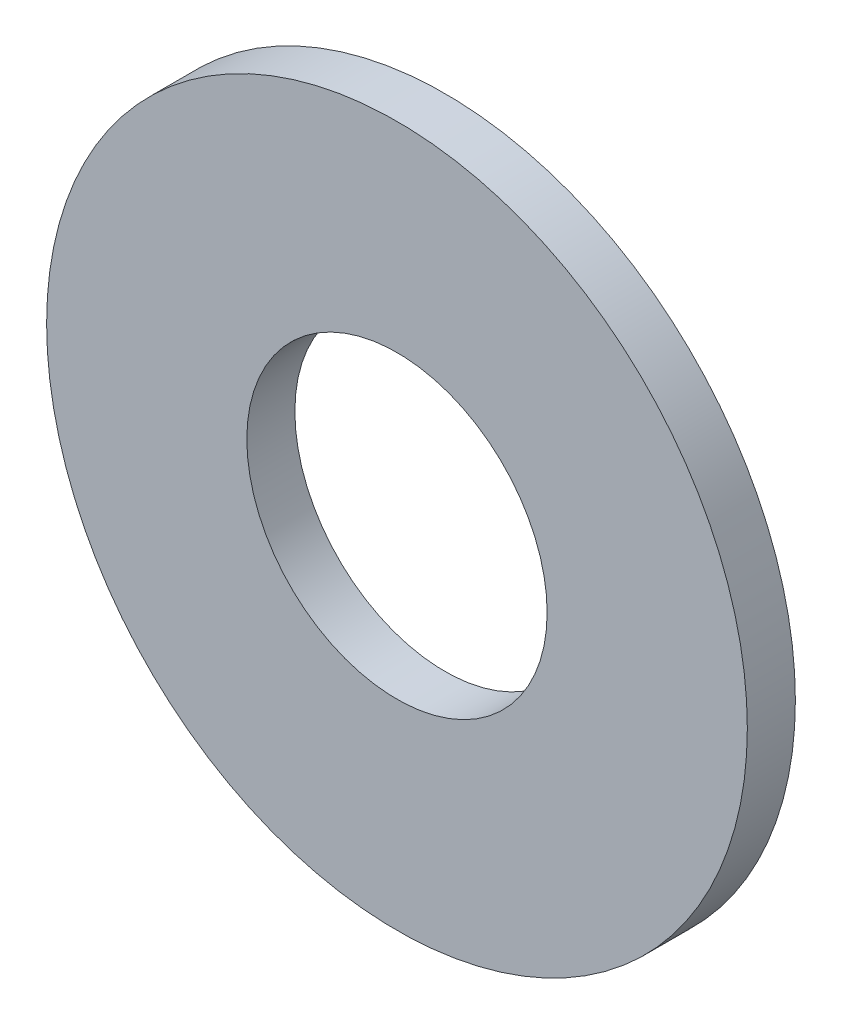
from build123d import *

# Parameters (mm, degrees)
SKETCH1_R      = 5.55625
SKETCH1_R_2    = 2.38125
EXTRUDE1_DEPTH = 0.762


with BuildPart() as part:
    # Sketch1 → Extrude1 (new body)
    with BuildSketch(Plane.XY):
        Circle(SKETCH1_R)
        Circle(SKETCH1_R_2, mode=Mode.SUBTRACT)
    extrude(amount=-EXTRUDE1_DEPTH)


solid = part.part
